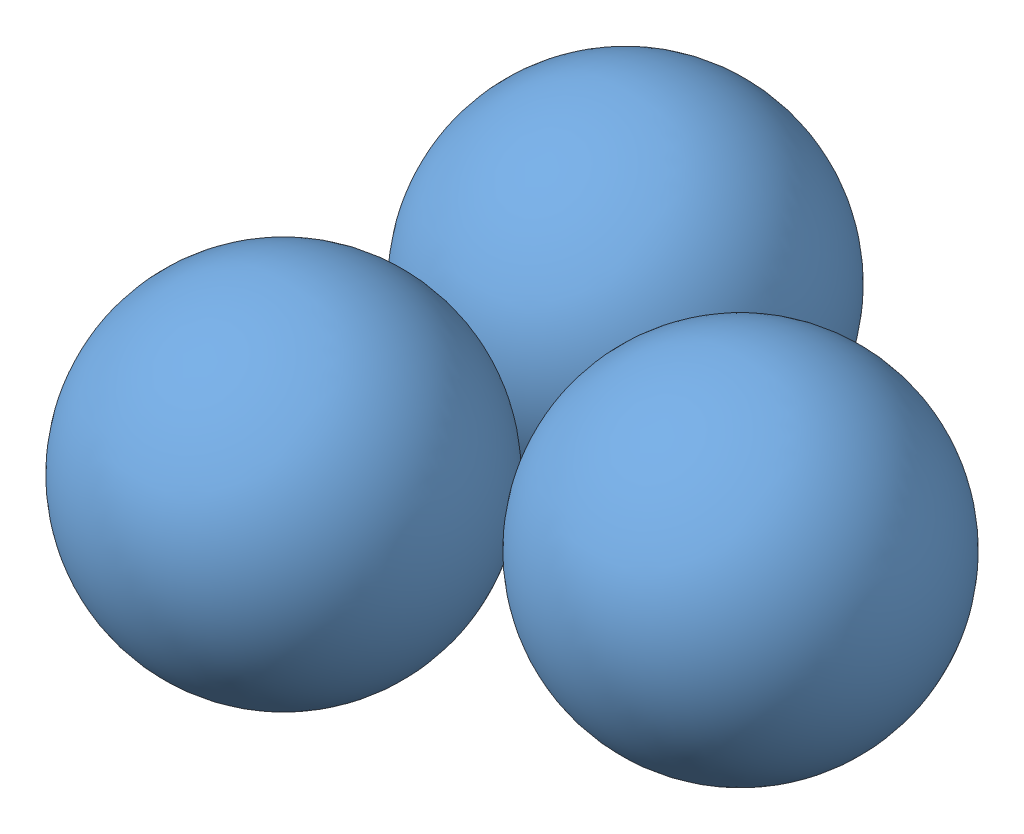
SolidWorks assembly Water Bundle.SLDASM, configuration Default (file format 9000). Lengths in mm.
Overall size (71.42 38.1 76.19).
3 component instances, 1 part files, 6 mates.
Components (placement in the parent):
- pom neon blue-1: pom neon blue.SLDPRT [Default] at (-0.0731 0 34.8731) size (38.1 38.1 38.1)
- pom neon blue-2: pom neon blue.SLDPRT [Default] at (33.2501 0 16.4021) size (38.1 38.1 38.1)
- pom neon blue-3: pom neon blue.SLDPRT [Default] at (0.5922 0 -3.2211) size (38.1 38.1 38.1)
Mates (geometry in assembly coordinates):
- Tangent7: tangent anti-aligned: sphere of pom neon blue-1; plane of assembly
- Tangent8: tangent anti-aligned: sphere of pom neon blue-2; plane of assembly
- Tangent9: tangent anti-aligned: sphere of pom neon blue-3; plane of assembly
- Tangent10: tangent anti-aligned: sphere of pom neon blue-1; sphere of pom neon blue-3
- Tangent11: tangent anti-aligned: sphere of pom neon blue-2; sphere of pom neon blue-3
- Tangent12: tangent anti-aligned: sphere of pom neon blue-1; sphere of pom neon blue-2
